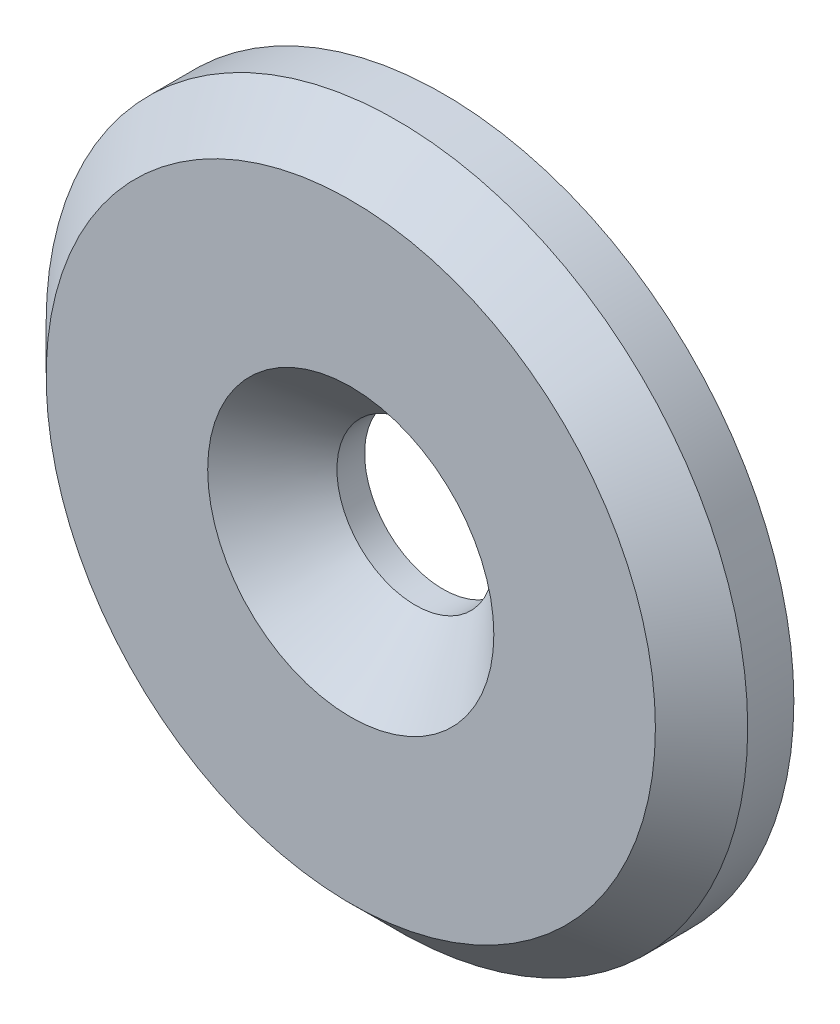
from build123d import *

# Parameters (mm, degrees)
ESQUISSE1_R          = 19
ESQUISSE1_R_2        = 4.25
BASE_EXTRUSION_DEPTH = 5
CHANFREIN1_SIZE      = 2.5
CHANFREIN2_SIZE      = 3.5


with BuildPart() as part:
    # Esquisse1 → Base-Extrusion (new body)
    with BuildSketch(Plane.XY):
        Circle(ESQUISSE1_R)
        Circle(ESQUISSE1_R_2, mode=Mode.SUBTRACT)
    extrude(amount=BASE_EXTRUSION_DEPTH)

    # Chanfrein1
    chanfrein1_edges = [part.edges().sort_by_distance(p)[0] for p in [
        (-19, 0, 5),
    ]]
    chamfer(chanfrein1_edges, length=CHANFREIN1_SIZE)

    # Chanfrein2
    chanfrein2_edges = [part.edges().sort_by_distance(p)[0] for p in [
        (-4.25, 0, 5),
    ]]
    chamfer(chanfrein2_edges, length=CHANFREIN2_SIZE)


solid = part.part
